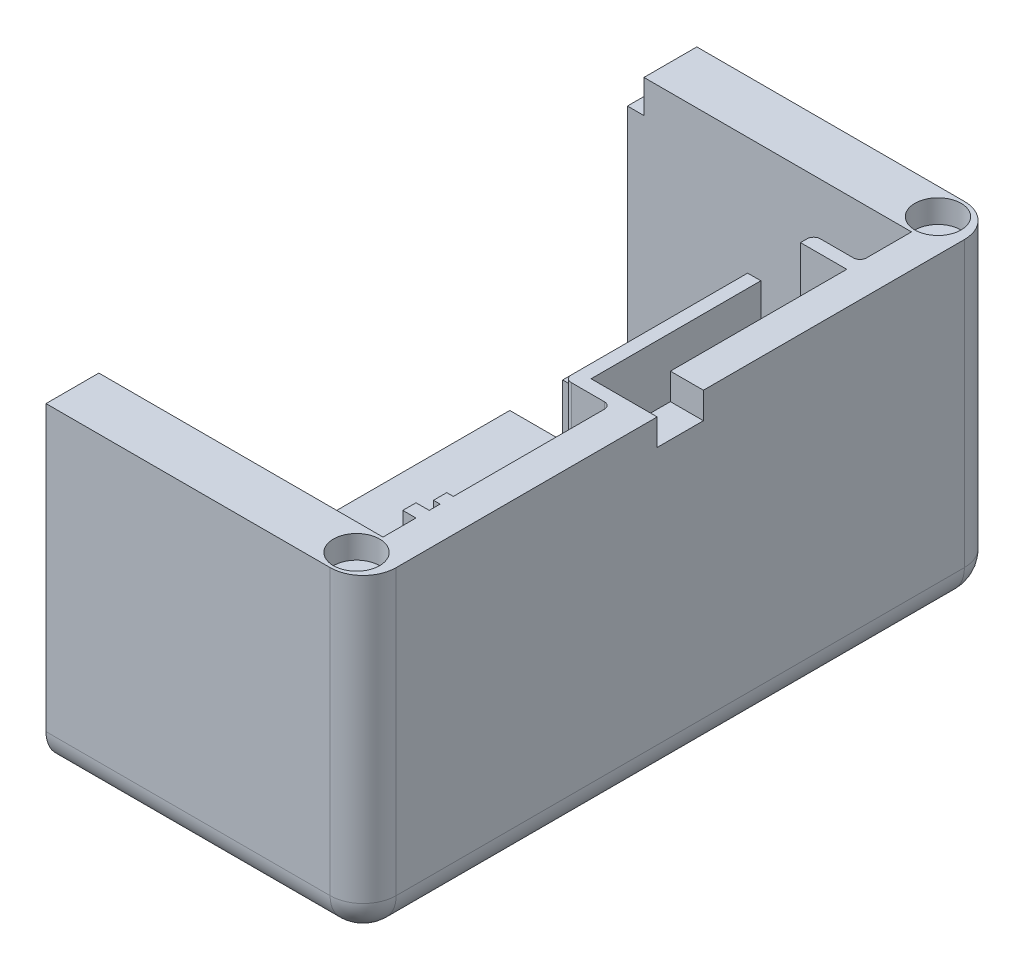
from build123d import *

# Parameters (mm, degrees)
SKETCH1_W                = 48
SKETCH1_H                = 48
BOSS_EXTRUDE1_DEPTH      = 8
BOSS_EXTRUDE2_DEPTH      = 80
SKETCH3_W                = 48
SKETCH3_H                = 48
BOSS_EXTRUDE3_DEPTH      = 8
FILLET1_R                = 5
SKETCH4_W                = 7
SKETCH4_H                = 4
CUT_EXTRUDE1_DEPTH       = 10
BOSS_EXTRUDE4_DEPTH      = 7
SKETCH6_W                = 2
SKETCH6_H                = 33.69370628
BOSS_EXTRUDE5_DEPTH      = 9
SKETCH8_W                = 8
SKETCH8_H                = 9
CUT_EXTRUDE2_DEPTH       = 5
SKETCH12_R               = 3.5
CUT_EXTRUDE9_DEPTH       = 3.5
MIRROR3_COPY_1_SKETCH_R  = 3.5
MIRROR3_COPY_1_DEPTH     = 3.5
SKETCH13_W               = 2.5
SKETCH13_H               = 5
CUT_EXTRUDE10_DEPTH      = 10
SKETCH16_R               = 1.59
CUT_EXTRUDE12_DEPTH      = 22.5
SKETCH17_W               = 2
SKETCH17_H               = 8.126
CUT_EXTRUDE13_DEPTH      = 5
SKETCH18_R               = 1.59
BOSS_EXTRUDE6_DEPTH      = 5
BOSS_EXTRUDE7_DEPTH      = 2
BOSS_EXTRUDE7_DEPTH_BACK = 5
SKETCH19_W               = 2
SKETCH19_H               = 8.126
BOSS_EXTRUDE8_DEPTH      = 1
BOSS_EXTRUDE8_DEPTH_BACK = 5
SKETCH20_W               = 2
SKETCH20_H               = 8.126
FILLET2_R                = 1
FILLET3_R                = 1
BOSS_EXTRUDE9_REACH      = 108.79
SKETCH21_R               = 1.59


with BuildPart() as part:
    # Sketch1 → Boss-Extrude1 (new body)
    with BuildSketch(Plane.XY):
        with Locations((1.44697784, 15.25)):
            Rectangle(SKETCH1_W, SKETCH1_H)
    extrude(amount=BOSS_EXTRUDE1_DEPTH)

    # Sketch2 → Boss-Extrude2 (add)
    with BuildSketch(Plane.XY.offset(8)):
        Polygon((-22.55302216, -8.75), (25.44697784, -8.75), (25.44697784, -3.75), (25.44697784, 39.25), (20.44697784, 39.25), (20.44697784, -3.75), (-22.55302216, -3.75), align=None)
    extrude(amount=BOSS_EXTRUDE2_DEPTH)

    # Sketch3 → Boss-Extrude3 (add)
    with BuildSketch(Plane.XY.offset(88)):
        with Locations((1.44697784, 15.25)):
            Rectangle(SKETCH3_W, SKETCH3_H)
    extrude(amount=BOSS_EXTRUDE3_DEPTH)

    # Fillet1
    fillet1_edges = [part.edges().sort_by_distance(p)[0] for p in [
        (1.44697784, -8.75, 96),
        (25.44697784, 15.25, 96),
        (25.44697784, 15.25, 0),
        (1.44697784, -8.75, 0),
        (25.44697784, -8.75, 48),
    ]]
    fillet(fillet1_edges, radius=FILLET1_R)

    # Sketch4 → Cut-Extrude1 (cut)
    with BuildSketch(Plane(origin=(25.44697784, 0, 0), x_dir=(0, 0, -1), z_dir=(1, 0, 0))):
        with Locations((-48, 37.25)):
            Rectangle(SKETCH4_W, SKETCH4_H)
    cut_extrude1 = extrude(amount=-CUT_EXTRUDE1_DEPTH, mode=Mode.SUBTRACT)

    # Sketch5 → Boss-Extrude4 (add)
    with BuildSketch(Plane.ZY.offset(-20.44697784)):
        Polygon((53.5, 39.25), (51.5, 39.25), (51.5, 35.25), (51.5, 30.25), (17.80629372, 30.25), (17.80629372, 39.25), (15.80629372, 39.25), (15.80629372, 28.25), (53.5, 28.25), align=None)
    boss_extrude4 = extrude(amount=BOSS_EXTRUDE4_DEPTH)

    # Sketch6 → Boss-Extrude5 (add)
    with BuildSketch(Plane(origin=(0, 30.25, 0), x_dir=(1, 0, 0), z_dir=(0, 1, 0))):
        with Locations((14.44697784, -34.65314686)):
            Rectangle(SKETCH6_W, SKETCH6_H)
    boss_extrude5 = extrude(amount=BOSS_EXTRUDE5_DEPTH)

    # Sketch8 → Cut-Extrude2 (cut)
    with BuildSketch(Plane.ZY.offset(-13.44697784)):
        with Locations((21.80629372, 34.75)):
            Rectangle(SKETCH8_W, SKETCH8_H)
    cut_extrude2 = extrude(amount=-CUT_EXTRUDE2_DEPTH, mode=Mode.SUBTRACT)

    # Mirror1: Cut-Extrude1, Boss-Extrude4, Boss-Extrude5, Cut-Extrude2 across plane
    add(cut_extrude1.mirror(Plane(origin=(8.34848892, 8.34848892, 0), x_dir=(0, 0, 1), z_dir=(0.7071067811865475, 0.7071067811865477, 0))), mode=Mode.SUBTRACT)
    add(boss_extrude4.mirror(Plane(origin=(8.34848892, 8.34848892, 0), x_dir=(0, 0, 1), z_dir=(0.7071067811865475, 0.7071067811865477, 0))))
    add(boss_extrude5.mirror(Plane(origin=(8.34848892, 8.34848892, 0), x_dir=(0, 0, 1), z_dir=(0.7071067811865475, 0.7071067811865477, 0))))
    add(cut_extrude2.mirror(Plane(origin=(8.34848892, 8.34848892, 0), x_dir=(0, 0, 1), z_dir=(0.7071067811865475, 0.7071067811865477, 0))), mode=Mode.SUBTRACT)

    # Sketch12 → Cut-Extrude9 (cut)
    with BuildSketch(Plane(origin=(0, 39.25, 0), x_dir=(1, 0, 0), z_dir=(0, 1, 0))):
        with Locations(Location((20.44697784, -92, 0), (0, 0, 270))):
            Circle(SKETCH12_R)
    cut_extrude9 = extrude(amount=-CUT_EXTRUDE9_DEPTH, mode=Mode.SUBTRACT)

    # Mirror2: Cut-Extrude9 across plane
    add(cut_extrude9.mirror(Plane(origin=(8.34848892, 8.34848892, 0), x_dir=(0, 0, 1), z_dir=(0.7071067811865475, 0.7071067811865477, 0))), mode=Mode.SUBTRACT)

    # Mirror3: Cut-Extrude9 across plane
    add(cut_extrude9.mirror(Plane.XY.offset(48)), mode=Mode.SUBTRACT)

    # Mirror3 copy 1 sketch → Mirror3 copy 1 (cut)
    with BuildSketch(Plane(origin=(-22.55302216, 16.69697784, 96), x_dir=(0, -1, 0), z_dir=(-1, 0, 0))):
        with Locations(Location((20.44697784, -92, 0), (0, 0, 270))):
            Circle(MIRROR3_COPY_1_SKETCH_R)
    extrude(amount=-MIRROR3_COPY_1_DEPTH, mode=Mode.SUBTRACT)

    # Sketch13 → Cut-Extrude10 (cut)
    with BuildSketch(Plane(origin=(0, 0, 0), x_dir=(-1, 0, 0), z_dir=(0, 0, -1))):
        with Locations((21.30302216, 36.75)):
            Rectangle(SKETCH13_W, SKETCH13_H)
    extrude(amount=-CUT_EXTRUDE10_DEPTH, mode=Mode.SUBTRACT)

    # Sketch16 → Cut-Extrude12 (cut, symmetric)
    with BuildSketch(Plane(origin=(50.785385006, 4.582668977, 73.639586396), x_dir=(-1, 0, 0), z_dir=(0, 0, -1))):
        with Locations(Location((55.728407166, 7.487331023, 0), (0, 0, 270))):
            Circle(SKETCH16_R)
    extrude(amount=CUT_EXTRUDE12_DEPTH, both=True, mode=Mode.SUBTRACT)

    # Sketch17 → Cut-Extrude13 (cut)
    with BuildSketch(Plane(origin=(20.44697784, 73.917331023, 45), x_dir=(0, 0, -1), z_dir=(-1, 0, 0))):
        with Locations((-37, 38.730331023)):
            Rectangle(SKETCH17_W, SKETCH17_H)
        with Locations((-33.35, 38.730331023)):
            Rectangle(SKETCH17_W, SKETCH17_H)
    extrude(amount=-CUT_EXTRUDE13_DEPTH, mode=Mode.SUBTRACT)

    # Sketch18 → Boss-Extrude6 (add)
    with BuildSketch(Plane(origin=(0, 0, 88), x_dir=(-1, 0, 0), z_dir=(0, 0, -1))):
        with Locations(Location((4.94302216, 12.07, 0), (0, 0, 270))):
            Circle(SKETCH18_R)
    extrude(amount=-BOSS_EXTRUDE6_DEPTH)

    # Sketch19 → Boss-Extrude7 (add, two sides: drawn at the far end of the back side and taken through both)
    with BuildSketch(Plane.ZY.offset(-20.44697784).offset(-BOSS_EXTRUDE7_DEPTH_BACK)):
        with Locations((82, 35.187)):
            Rectangle(SKETCH19_W, SKETCH19_H)
    extrude(amount=BOSS_EXTRUDE7_DEPTH + BOSS_EXTRUDE7_DEPTH_BACK)

    # Sketch20 → Boss-Extrude8 (add, two sides: drawn at the far end of the back side and taken through both)
    with BuildSketch(Plane.ZY.offset(-20.44697784).offset(-BOSS_EXTRUDE8_DEPTH_BACK)):
        with Locations((78.35, 35.187)):
            Rectangle(SKETCH20_W, SKETCH20_H)
    extrude(amount=BOSS_EXTRUDE8_DEPTH + BOSS_EXTRUDE8_DEPTH_BACK)

    # Fillet2
    fillet2_edges = [part.edges().sort_by_distance(p)[0] for p in [
        (-17.05302216, 3.25, 53.5),
        (-11.55302216, -3.75, 34.65314686),
        (-11.55302216, -0.25, 53.5),
        (-17.05302216, 3.25, 15.80629372),
        (-11.55302216, -0.25, 15.80629372),
        (-11.55302216, 3.25, 34.65314686),
        (-17.05302216, -3.75, 15.80629372),
        (-17.05302216, -3.75, 53.5),
    ]]
    fillet(fillet2_edges, radius=FILLET2_R)

    # Fillet3
    fillet3_edges = [part.edges().sort_by_distance(p)[0] for p in [
        (20.44697784, 33.75, 15.80629372),
        (13.44697784, 28.25, 34.65314686),
        (20.44697784, 33.75, 53.5),
        (16.94697784, 28.25, 53.5),
        (13.44697784, 33.75, 15.80629372),
        (13.44697784, 33.75, 53.5),
        (20.44697784, 28.25, 34.65314686),
    ]]
    fillet(fillet3_edges, radius=FILLET3_R)

    # Sketch21 → Boss-Extrude9 (add, up to next)
    with BuildSketch(Plane.XY.offset(96), mode=Mode.PRIVATE) as boss_extrude9_sk1:
        with Locations((-4.94302216, 12.07)):
            Circle(SKETCH21_R)
    boss_extrude9_tool1 = extrude(boss_extrude9_sk1.sketch, amount=-BOSS_EXTRUDE9_REACH, mode=Mode.PRIVATE) - part.part
    add(boss_extrude9_tool1.solids().sort_by_distance((-4.943022, 12.07, 96))[0])


solid = part.part
